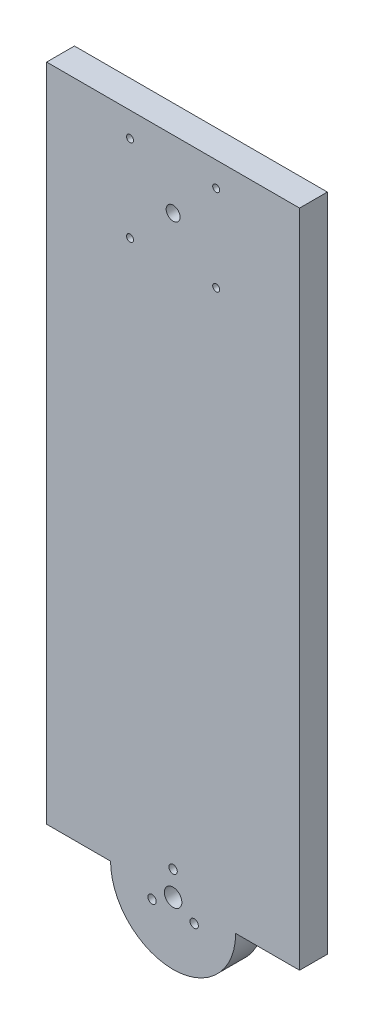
ISO-10303-21;
HEADER;
FILE_DESCRIPTION(('STEP AP214'),'2;1');
FILE_NAME('part.step','',(''),(''),'','','');
FILE_SCHEMA(('AUTOMOTIVE_DESIGN { 1 0 10303 214 1 1 1 1 }'));
ENDSEC;
DATA;
#1=APPLICATION_CONTEXT('core data for automotive mechanical design processes');
#2=APPLICATION_PROTOCOL_DEFINITION('international standard','automotive_design',2000,#1);
#3=PRODUCT_CONTEXT('',#1,'mechanical');
#4=PRODUCT('Part','Part','',(#3));
#5=PRODUCT_RELATED_PRODUCT_CATEGORY('part','',(#4));
#6=PRODUCT_DEFINITION_FORMATION('','',#4);
#7=PRODUCT_DEFINITION_CONTEXT('part definition',#1,'design');
#8=PRODUCT_DEFINITION('design','',#6,#7);
#9=PRODUCT_DEFINITION_SHAPE('','',#8);
#10=(LENGTH_UNIT() NAMED_UNIT(*) SI_UNIT(.MILLI.,.METRE.));
#11=(NAMED_UNIT(*) PLANE_ANGLE_UNIT() SI_UNIT($,.RADIAN.));
#12=(NAMED_UNIT(*) SI_UNIT($,.STERADIAN.) SOLID_ANGLE_UNIT());
#13=UNCERTAINTY_MEASURE_WITH_UNIT(LENGTH_MEASURE(1.E-05),#10,'distance_accuracy_value','');
#14=(GEOMETRIC_REPRESENTATION_CONTEXT(3) GLOBAL_UNCERTAINTY_ASSIGNED_CONTEXT((#13)) GLOBAL_UNIT_ASSIGNED_CONTEXT((#10,
#11,#12)) REPRESENTATION_CONTEXT('',''));
#15=CARTESIAN_POINT('',(0.,0.,0.));
#16=DIRECTION('',(0.,0.,1.));
#17=DIRECTION('',(1.,0.,0.));
#18=AXIS2_PLACEMENT_3D('',#15,#16,#17);
#19=CARTESIAN_POINT('',(5.46437894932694E-12,-107.5,10.));
#20=DIRECTION('',(0.,0.,1.));
#21=DIRECTION('',(1.,0.,0.));
#22=AXIS2_PLACEMENT_3D('',#19,#20,#21);
#23=PLANE('',#22);
#24=CARTESIAN_POINT('',(7.57772228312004,-111.875,10.));
#25=DIRECTION('',(0.,0.,1.));
#26=DIRECTION('',(1.,0.,0.));
#27=AXIS2_PLACEMENT_3D('',#24,#25,#26);
#28=CIRCLE('',#27,1.5);
#29=CARTESIAN_POINT('',(9.07772228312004,-111.875,10.));
#30=VERTEX_POINT('',#29);
#31=EDGE_CURVE('E134',#30,#30,#28,.T.);
#32=ORIENTED_EDGE('',*,*,#31,.F.);
#33=EDGE_LOOP('',(#32));
#34=FACE_BOUND('',#33,.T.);
#35=CARTESIAN_POINT('',(5.46437894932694E-12,-98.75,10.));
#36=DIRECTION('',(0.,0.,1.));
#37=DIRECTION('',(1.,0.,0.));
#38=AXIS2_PLACEMENT_3D('',#35,#36,#37);
#39=CIRCLE('',#38,1.5);
#40=CARTESIAN_POINT('',(1.50000000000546,-98.75,10.));
#41=VERTEX_POINT('',#40);
#42=EDGE_CURVE('E146',#41,#41,#39,.T.);
#43=ORIENTED_EDGE('',*,*,#42,.F.);
#44=EDGE_LOOP('',(#43));
#45=FACE_BOUND('',#44,.T.);
#46=CARTESIAN_POINT('',(-15.4999999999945,90.1639203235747,10.));
#47=DIRECTION('',(0.,0.,1.));
#48=DIRECTION('',(-1.,0.,0.));
#49=AXIS2_PLACEMENT_3D('',#46,#47,#48);
#50=CIRCLE('',#49,1.25);
#51=CARTESIAN_POINT('',(-16.7499999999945,90.1639203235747,10.));
#52=VERTEX_POINT('',#51);
#53=EDGE_CURVE('E158',#52,#52,#50,.T.);
#54=ORIENTED_EDGE('',*,*,#53,.F.);
#55=EDGE_LOOP('',(#54));
#56=FACE_BOUND('',#55,.T.);
#57=CARTESIAN_POINT('',(15.5000000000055,121.163920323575,10.));
#58=DIRECTION('',(0.,0.,1.));
#59=DIRECTION('',(-1.,0.,0.));
#60=AXIS2_PLACEMENT_3D('',#57,#58,#59);
#61=CIRCLE('',#60,1.25);
#62=CARTESIAN_POINT('',(14.2500000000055,121.163920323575,10.));
#63=VERTEX_POINT('',#62);
#64=EDGE_CURVE('E170',#63,#63,#61,.T.);
#65=ORIENTED_EDGE('',*,*,#64,.F.);
#66=EDGE_LOOP('',(#65));
#67=FACE_BOUND('',#66,.T.);
#68=DIRECTION('',(-1.,0.,0.));
#69=VECTOR('',#68,1.);
#70=CARTESIAN_POINT('',(-22.5,130.,10.));
#71=LINE('',#70,#69);
#72=CARTESIAN_POINT('',(45.5,130.,10.));
#73=VERTEX_POINT('',#72);
#74=CARTESIAN_POINT('',(-45.5,130.,10.));
#75=VERTEX_POINT('',#74);
#76=EDGE_CURVE('E182',#73,#75,#71,.T.);
#77=ORIENTED_EDGE('',*,*,#76,.T.);
#78=DIRECTION('',(0.,1.,0.));
#79=VECTOR('',#78,1.);
#80=CARTESIAN_POINT('',(-45.5,130.,10.));
#81=LINE('',#80,#79);
#82=CARTESIAN_POINT('',(-45.5,-107.5,10.));
#83=VERTEX_POINT('',#82);
#84=EDGE_CURVE('E93',#83,#75,#81,.T.);
#85=ORIENTED_EDGE('',*,*,#84,.F.);
#86=DIRECTION('',(1.,0.,0.));
#87=VECTOR('',#86,1.);
#88=CARTESIAN_POINT('',(-45.5,-107.5,10.));
#89=LINE('',#88,#87);
#90=CARTESIAN_POINT('',(-22.4999999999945,-107.5,10.));
#91=VERTEX_POINT('',#90);
#92=EDGE_CURVE('E89',#83,#91,#89,.T.);
#93=ORIENTED_EDGE('',*,*,#92,.T.);
#94=CARTESIAN_POINT('',(5.46437894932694E-12,-107.5,10.));
#95=DIRECTION('',(0.,0.,1.));
#96=DIRECTION('',(1.,0.,0.));
#97=AXIS2_PLACEMENT_3D('',#94,#95,#96);
#98=CIRCLE('',#97,22.5);
#99=CARTESIAN_POINT('',(22.5,-107.5,10.));
#100=VERTEX_POINT('',#99);
#101=EDGE_CURVE('E47',#91,#100,#98,.T.);
#102=ORIENTED_EDGE('',*,*,#101,.T.);
#103=DIRECTION('',(-1.,0.,0.));
#104=VECTOR('',#103,1.);
#105=CARTESIAN_POINT('',(45.5,-107.5,10.));
#106=LINE('',#105,#104);
#107=CARTESIAN_POINT('',(45.5,-107.5,10.));
#108=VERTEX_POINT('',#107);
#109=EDGE_CURVE('E125',#108,#100,#106,.T.);
#110=ORIENTED_EDGE('',*,*,#109,.F.);
#111=DIRECTION('',(0.,-1.,0.));
#112=VECTOR('',#111,1.);
#113=CARTESIAN_POINT('',(45.5,130.,10.));
#114=LINE('',#113,#112);
#115=EDGE_CURVE('E108',#73,#108,#114,.T.);
#116=ORIENTED_EDGE('',*,*,#115,.F.);
#117=EDGE_LOOP('',(#77,#85,#93,#102,#110,#116));
#118=FACE_BOUND('',#117,.T.);
#119=CARTESIAN_POINT('',(-15.4999999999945,121.163920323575,10.));
#120=DIRECTION('',(0.,0.,1.));
#121=DIRECTION('',(1.,0.,0.));
#122=AXIS2_PLACEMENT_3D('',#119,#120,#121);
#123=CIRCLE('',#122,1.25);
#124=CARTESIAN_POINT('',(-14.2499999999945,121.163920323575,10.));
#125=VERTEX_POINT('',#124);
#126=EDGE_CURVE('E176',#125,#125,#123,.T.);
#127=ORIENTED_EDGE('',*,*,#126,.F.);
#128=EDGE_LOOP('',(#127));
#129=FACE_BOUND('',#128,.T.);
#130=CARTESIAN_POINT('',(15.5000000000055,90.1639203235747,10.));
#131=DIRECTION('',(0.,0.,1.));
#132=DIRECTION('',(1.,0.,0.));
#133=AXIS2_PLACEMENT_3D('',#130,#131,#132);
#134=CIRCLE('',#133,1.25);
#135=CARTESIAN_POINT('',(16.7500000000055,90.1639203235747,10.));
#136=VERTEX_POINT('',#135);
#137=EDGE_CURVE('E164',#136,#136,#134,.T.);
#138=ORIENTED_EDGE('',*,*,#137,.F.);
#139=EDGE_LOOP('',(#138));
#140=FACE_BOUND('',#139,.T.);
#141=CARTESIAN_POINT('',(5.4678483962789E-12,105.663920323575,10.));
#142=DIRECTION('',(0.,0.,1.));
#143=DIRECTION('',(1.,0.,0.));
#144=AXIS2_PLACEMENT_3D('',#141,#142,#143);
#145=CIRCLE('',#144,2.5);
#146=CARTESIAN_POINT('',(2.50000000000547,105.663920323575,10.));
#147=VERTEX_POINT('',#146);
#148=EDGE_CURVE('E152',#147,#147,#145,.T.);
#149=ORIENTED_EDGE('',*,*,#148,.F.);
#150=EDGE_LOOP('',(#149));
#151=FACE_BOUND('',#150,.T.);
#152=CARTESIAN_POINT('',(5.46437894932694E-12,-107.5,10.));
#153=DIRECTION('',(0.,0.,1.));
#154=DIRECTION('',(1.,0.,0.));
#155=AXIS2_PLACEMENT_3D('',#152,#153,#154);
#156=CIRCLE('',#155,3.15);
#157=CARTESIAN_POINT('',(3.15000000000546,-107.5,10.));
#158=VERTEX_POINT('',#157);
#159=EDGE_CURVE('E140',#158,#158,#156,.T.);
#160=ORIENTED_EDGE('',*,*,#159,.F.);
#161=EDGE_LOOP('',(#160));
#162=FACE_BOUND('',#161,.T.);
#163=CARTESIAN_POINT('',(-7.5777222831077,-111.875,10.));
#164=DIRECTION('',(0.,0.,1.));
#165=DIRECTION('',(1.,0.,0.));
#166=AXIS2_PLACEMENT_3D('',#163,#164,#165);
#167=CIRCLE('',#166,1.49999999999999);
#168=CARTESIAN_POINT('',(-6.07772228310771,-111.875,10.));
#169=VERTEX_POINT('',#168);
#170=EDGE_CURVE('E128',#169,#169,#167,.T.);
#171=ORIENTED_EDGE('',*,*,#170,.F.);
#172=EDGE_LOOP('',(#171));
#173=FACE_BOUND('',#172,.T.);
#174=ADVANCED_FACE('F33',(#34,#45,#56,#67,#118,#129,#140,#151,#162,#173),#23,.T.);
#175=CARTESIAN_POINT('',(5.46437894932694E-12,-107.5,0.));
#176=DIRECTION('',(0.,0.,1.));
#177=DIRECTION('',(1.,0.,0.));
#178=AXIS2_PLACEMENT_3D('',#175,#176,#177);
#179=PLANE('',#178);
#180=CARTESIAN_POINT('',(5.46437894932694E-12,-107.5,0.));
#181=DIRECTION('',(0.,0.,1.));
#182=DIRECTION('',(1.,0.,0.));
#183=AXIS2_PLACEMENT_3D('',#180,#181,#182);
#184=CIRCLE('',#183,22.5);
#185=CARTESIAN_POINT('',(-22.4999999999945,-107.5,0.));
#186=VERTEX_POINT('',#185);
#187=CARTESIAN_POINT('',(22.5,-107.5,0.));
#188=VERTEX_POINT('',#187);
#189=EDGE_CURVE('E107',#186,#188,#184,.T.);
#190=ORIENTED_EDGE('',*,*,#189,.F.);
#191=DIRECTION('',(1.,0.,0.));
#192=VECTOR('',#191,1.);
#193=CARTESIAN_POINT('',(-45.5,-107.5,0.));
#194=LINE('',#193,#192);
#195=CARTESIAN_POINT('',(-45.5,-107.5,0.));
#196=VERTEX_POINT('',#195);
#197=EDGE_CURVE('E87',#196,#186,#194,.T.);
#198=ORIENTED_EDGE('',*,*,#197,.F.);
#199=DIRECTION('',(0.,-1.,0.));
#200=VECTOR('',#199,1.);
#201=CARTESIAN_POINT('',(-45.5,130.,0.));
#202=LINE('',#201,#200);
#203=CARTESIAN_POINT('',(-45.5,130.,0.));
#204=VERTEX_POINT('',#203);
#205=EDGE_CURVE('E94',#204,#196,#202,.T.);
#206=ORIENTED_EDGE('',*,*,#205,.F.);
#207=DIRECTION('',(-1.,0.,0.));
#208=VECTOR('',#207,1.);
#209=CARTESIAN_POINT('',(-22.5,130.,0.));
#210=LINE('',#209,#208);
#211=CARTESIAN_POINT('',(45.5,130.,0.));
#212=VERTEX_POINT('',#211);
#213=EDGE_CURVE('E183',#212,#204,#210,.T.);
#214=ORIENTED_EDGE('',*,*,#213,.F.);
#215=DIRECTION('',(0.,1.,0.));
#216=VECTOR('',#215,1.);
#217=CARTESIAN_POINT('',(45.5,130.,0.));
#218=LINE('',#217,#216);
#219=CARTESIAN_POINT('',(45.5,-107.5,0.));
#220=VERTEX_POINT('',#219);
#221=EDGE_CURVE('E117',#220,#212,#218,.T.);
#222=ORIENTED_EDGE('',*,*,#221,.F.);
#223=DIRECTION('',(-1.,0.,0.));
#224=VECTOR('',#223,1.);
#225=CARTESIAN_POINT('',(45.5,-107.5,0.));
#226=LINE('',#225,#224);
#227=EDGE_CURVE('E123',#220,#188,#226,.T.);
#228=ORIENTED_EDGE('',*,*,#227,.T.);
#229=EDGE_LOOP('',(#190,#198,#206,#214,#222,#228));
#230=FACE_BOUND('',#229,.T.);
#231=CARTESIAN_POINT('',(-15.4999999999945,121.163920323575,0.));
#232=DIRECTION('',(0.,0.,1.));
#233=DIRECTION('',(1.,0.,0.));
#234=AXIS2_PLACEMENT_3D('',#231,#232,#233);
#235=CIRCLE('',#234,1.25);
#236=CARTESIAN_POINT('',(-14.2499999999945,121.163920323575,0.));
#237=VERTEX_POINT('',#236);
#238=EDGE_CURVE('E173',#237,#237,#235,.T.);
#239=ORIENTED_EDGE('',*,*,#238,.T.);
#240=EDGE_LOOP('',(#239));
#241=FACE_BOUND('',#240,.T.);
#242=CARTESIAN_POINT('',(15.5000000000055,121.163920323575,0.));
#243=DIRECTION('',(0.,0.,1.));
#244=DIRECTION('',(-1.,0.,0.));
#245=AXIS2_PLACEMENT_3D('',#242,#243,#244);
#246=CIRCLE('',#245,1.25);
#247=CARTESIAN_POINT('',(14.2500000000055,121.163920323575,0.));
#248=VERTEX_POINT('',#247);
#249=EDGE_CURVE('E167',#248,#248,#246,.T.);
#250=ORIENTED_EDGE('',*,*,#249,.T.);
#251=EDGE_LOOP('',(#250));
#252=FACE_BOUND('',#251,.T.);
#253=CARTESIAN_POINT('',(15.5000000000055,90.1639203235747,0.));
#254=DIRECTION('',(0.,0.,1.));
#255=DIRECTION('',(1.,0.,0.));
#256=AXIS2_PLACEMENT_3D('',#253,#254,#255);
#257=CIRCLE('',#256,1.25);
#258=CARTESIAN_POINT('',(16.7500000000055,90.1639203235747,0.));
#259=VERTEX_POINT('',#258);
#260=EDGE_CURVE('E161',#259,#259,#257,.T.);
#261=ORIENTED_EDGE('',*,*,#260,.T.);
#262=EDGE_LOOP('',(#261));
#263=FACE_BOUND('',#262,.T.);
#264=CARTESIAN_POINT('',(-15.4999999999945,90.1639203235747,0.));
#265=DIRECTION('',(0.,0.,1.));
#266=DIRECTION('',(-1.,0.,0.));
#267=AXIS2_PLACEMENT_3D('',#264,#265,#266);
#268=CIRCLE('',#267,1.25);
#269=CARTESIAN_POINT('',(-16.7499999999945,90.1639203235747,0.));
#270=VERTEX_POINT('',#269);
#271=EDGE_CURVE('E155',#270,#270,#268,.T.);
#272=ORIENTED_EDGE('',*,*,#271,.T.);
#273=EDGE_LOOP('',(#272));
#274=FACE_BOUND('',#273,.T.);
#275=CARTESIAN_POINT('',(5.4678483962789E-12,105.663920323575,0.));
#276=DIRECTION('',(0.,0.,1.));
#277=DIRECTION('',(1.,0.,0.));
#278=AXIS2_PLACEMENT_3D('',#275,#276,#277);
#279=CIRCLE('',#278,2.5);
#280=CARTESIAN_POINT('',(2.50000000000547,105.663920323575,0.));
#281=VERTEX_POINT('',#280);
#282=EDGE_CURVE('E149',#281,#281,#279,.T.);
#283=ORIENTED_EDGE('',*,*,#282,.T.);
#284=EDGE_LOOP('',(#283));
#285=FACE_BOUND('',#284,.T.);
#286=CARTESIAN_POINT('',(5.46437894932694E-12,-98.75,0.));
#287=DIRECTION('',(0.,0.,1.));
#288=DIRECTION('',(1.,0.,0.));
#289=AXIS2_PLACEMENT_3D('',#286,#287,#288);
#290=CIRCLE('',#289,1.5);
#291=CARTESIAN_POINT('',(1.50000000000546,-98.75,0.));
#292=VERTEX_POINT('',#291);
#293=EDGE_CURVE('E143',#292,#292,#290,.T.);
#294=ORIENTED_EDGE('',*,*,#293,.T.);
#295=EDGE_LOOP('',(#294));
#296=FACE_BOUND('',#295,.T.);
#297=CARTESIAN_POINT('',(5.46437894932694E-12,-107.5,0.));
#298=DIRECTION('',(0.,0.,1.));
#299=DIRECTION('',(1.,0.,0.));
#300=AXIS2_PLACEMENT_3D('',#297,#298,#299);
#301=CIRCLE('',#300,3.15);
#302=CARTESIAN_POINT('',(3.15000000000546,-107.5,0.));
#303=VERTEX_POINT('',#302);
#304=EDGE_CURVE('E137',#303,#303,#301,.T.);
#305=ORIENTED_EDGE('',*,*,#304,.T.);
#306=EDGE_LOOP('',(#305));
#307=FACE_BOUND('',#306,.T.);
#308=CARTESIAN_POINT('',(7.57772228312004,-111.875,0.));
#309=DIRECTION('',(0.,0.,1.));
#310=DIRECTION('',(1.,0.,0.));
#311=AXIS2_PLACEMENT_3D('',#308,#309,#310);
#312=CIRCLE('',#311,1.5);
#313=CARTESIAN_POINT('',(9.07772228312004,-111.875,0.));
#314=VERTEX_POINT('',#313);
#315=EDGE_CURVE('E131',#314,#314,#312,.T.);
#316=ORIENTED_EDGE('',*,*,#315,.T.);
#317=EDGE_LOOP('',(#316));
#318=FACE_BOUND('',#317,.T.);
#319=CARTESIAN_POINT('',(-7.5777222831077,-111.875,0.));
#320=DIRECTION('',(0.,0.,1.));
#321=DIRECTION('',(1.,0.,0.));
#322=AXIS2_PLACEMENT_3D('',#319,#320,#321);
#323=CIRCLE('',#322,1.49999999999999);
#324=CARTESIAN_POINT('',(-6.07772228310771,-111.875,0.));
#325=VERTEX_POINT('',#324);
#326=EDGE_CURVE('E127',#325,#325,#323,.T.);
#327=ORIENTED_EDGE('',*,*,#326,.T.);
#328=EDGE_LOOP('',(#327));
#329=FACE_BOUND('',#328,.T.);
#330=ADVANCED_FACE('F103',(#230,#241,#252,#263,#274,#285,#296,#307,#318,#329),#179,.F.);
#331=CARTESIAN_POINT('',(5.46437894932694E-12,-107.5,10.));
#332=DIRECTION('',(0.,0.,-1.));
#333=DIRECTION('',(-1.,0.,0.));
#334=AXIS2_PLACEMENT_3D('',#331,#332,#333);
#335=CYLINDRICAL_SURFACE('',#334,22.5);
#336=ORIENTED_EDGE('',*,*,#189,.T.);
#337=DIRECTION('',(0.,0.,-1.));
#338=VECTOR('',#337,1.);
#339=CARTESIAN_POINT('',(22.5,-107.5,10.));
#340=LINE('',#339,#338);
#341=EDGE_CURVE('E42',#100,#188,#340,.T.);
#342=ORIENTED_EDGE('',*,*,#341,.F.);
#343=ORIENTED_EDGE('',*,*,#101,.F.);
#344=DIRECTION('',(0.,0.,-1.));
#345=VECTOR('',#344,1.);
#346=CARTESIAN_POINT('',(-22.4999999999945,-107.5,10.));
#347=LINE('',#346,#345);
#348=EDGE_CURVE('E11',#91,#186,#347,.T.);
#349=ORIENTED_EDGE('',*,*,#348,.T.);
#350=EDGE_LOOP('',(#336,#342,#343,#349));
#351=FACE_BOUND('',#350,.T.);
#352=ADVANCED_FACE('F35',(#351),#335,.T.);
#353=CARTESIAN_POINT('',(-22.5,130.,10.));
#354=DIRECTION('',(0.,-1.,0.));
#355=DIRECTION('',(0.,0.,-1.));
#356=AXIS2_PLACEMENT_3D('',#353,#354,#355);
#357=PLANE('',#356);
#358=ORIENTED_EDGE('',*,*,#213,.T.);
#359=DIRECTION('',(0.,0.,-1.));
#360=VECTOR('',#359,1.);
#361=CARTESIAN_POINT('',(-45.5,130.,0.));
#362=LINE('',#361,#360);
#363=EDGE_CURVE('E100',#75,#204,#362,.T.);
#364=ORIENTED_EDGE('',*,*,#363,.F.);
#365=ORIENTED_EDGE('',*,*,#76,.F.);
#366=DIRECTION('',(0.,0.,1.));
#367=VECTOR('',#366,1.);
#368=CARTESIAN_POINT('',(45.5,130.,10.));
#369=LINE('',#368,#367);
#370=EDGE_CURVE('E120',#212,#73,#369,.T.);
#371=ORIENTED_EDGE('',*,*,#370,.F.);
#372=EDGE_LOOP('',(#358,#364,#365,#371));
#373=FACE_BOUND('',#372,.T.);
#374=ADVANCED_FACE('F196',(#373),#357,.F.);
#375=CARTESIAN_POINT('',(-15.4999999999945,121.163920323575,10.));
#376=DIRECTION('',(0.,0.,-1.));
#377=DIRECTION('',(-1.,0.,0.));
#378=AXIS2_PLACEMENT_3D('',#375,#376,#377);
#379=CYLINDRICAL_SURFACE('',#378,1.25);
#380=ORIENTED_EDGE('',*,*,#126,.T.);
#381=EDGE_LOOP('',(#380));
#382=FACE_BOUND('',#381,.T.);
#383=ORIENTED_EDGE('',*,*,#238,.F.);
#384=EDGE_LOOP('',(#383));
#385=FACE_BOUND('',#384,.T.);
#386=ADVANCED_FACE('F220',(#382,#385),#379,.F.);
#387=CARTESIAN_POINT('',(15.5000000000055,121.163920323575,10.));
#388=DIRECTION('',(0.,0.,-1.));
#389=DIRECTION('',(-1.,0.,0.));
#390=AXIS2_PLACEMENT_3D('',#387,#388,#389);
#391=CYLINDRICAL_SURFACE('',#390,1.25);
#392=ORIENTED_EDGE('',*,*,#64,.T.);
#393=EDGE_LOOP('',(#392));
#394=FACE_BOUND('',#393,.T.);
#395=ORIENTED_EDGE('',*,*,#249,.F.);
#396=EDGE_LOOP('',(#395));
#397=FACE_BOUND('',#396,.T.);
#398=ADVANCED_FACE('F226',(#394,#397),#391,.F.);
#399=CARTESIAN_POINT('',(15.5000000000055,90.1639203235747,10.));
#400=DIRECTION('',(0.,0.,-1.));
#401=DIRECTION('',(-1.,0.,0.));
#402=AXIS2_PLACEMENT_3D('',#399,#400,#401);
#403=CYLINDRICAL_SURFACE('',#402,1.25);
#404=ORIENTED_EDGE('',*,*,#137,.T.);
#405=EDGE_LOOP('',(#404));
#406=FACE_BOUND('',#405,.T.);
#407=ORIENTED_EDGE('',*,*,#260,.F.);
#408=EDGE_LOOP('',(#407));
#409=FACE_BOUND('',#408,.T.);
#410=ADVANCED_FACE('F336',(#406,#409),#403,.F.);
#411=CARTESIAN_POINT('',(-15.4999999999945,90.1639203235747,10.));
#412=DIRECTION('',(0.,0.,-1.));
#413=DIRECTION('',(-1.,0.,0.));
#414=AXIS2_PLACEMENT_3D('',#411,#412,#413);
#415=CYLINDRICAL_SURFACE('',#414,1.25);
#416=ORIENTED_EDGE('',*,*,#53,.T.);
#417=EDGE_LOOP('',(#416));
#418=FACE_BOUND('',#417,.T.);
#419=ORIENTED_EDGE('',*,*,#271,.F.);
#420=EDGE_LOOP('',(#419));
#421=FACE_BOUND('',#420,.T.);
#422=ADVANCED_FACE('F326',(#418,#421),#415,.F.);
#423=CARTESIAN_POINT('',(5.4678483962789E-12,105.663920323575,10.));
#424=DIRECTION('',(0.,0.,-1.));
#425=DIRECTION('',(-1.,0.,0.));
#426=AXIS2_PLACEMENT_3D('',#423,#424,#425);
#427=CYLINDRICAL_SURFACE('',#426,2.5);
#428=ORIENTED_EDGE('',*,*,#148,.T.);
#429=EDGE_LOOP('',(#428));
#430=FACE_BOUND('',#429,.T.);
#431=ORIENTED_EDGE('',*,*,#282,.F.);
#432=EDGE_LOOP('',(#431));
#433=FACE_BOUND('',#432,.T.);
#434=ADVANCED_FACE('F316',(#430,#433),#427,.F.);
#435=CARTESIAN_POINT('',(5.46437894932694E-12,-98.75,10.));
#436=DIRECTION('',(0.,0.,-1.));
#437=DIRECTION('',(-1.,0.,0.));
#438=AXIS2_PLACEMENT_3D('',#435,#436,#437);
#439=CYLINDRICAL_SURFACE('',#438,1.5);
#440=ORIENTED_EDGE('',*,*,#42,.T.);
#441=EDGE_LOOP('',(#440));
#442=FACE_BOUND('',#441,.T.);
#443=ORIENTED_EDGE('',*,*,#293,.F.);
#444=EDGE_LOOP('',(#443));
#445=FACE_BOUND('',#444,.T.);
#446=ADVANCED_FACE('F306',(#442,#445),#439,.F.);
#447=CARTESIAN_POINT('',(5.46437894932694E-12,-107.5,10.));
#448=DIRECTION('',(0.,0.,-1.));
#449=DIRECTION('',(-1.,0.,0.));
#450=AXIS2_PLACEMENT_3D('',#447,#448,#449);
#451=CYLINDRICAL_SURFACE('',#450,3.15);
#452=ORIENTED_EDGE('',*,*,#159,.T.);
#453=EDGE_LOOP('',(#452));
#454=FACE_BOUND('',#453,.T.);
#455=ORIENTED_EDGE('',*,*,#304,.F.);
#456=EDGE_LOOP('',(#455));
#457=FACE_BOUND('',#456,.T.);
#458=ADVANCED_FACE('F296',(#454,#457),#451,.F.);
#459=CARTESIAN_POINT('',(7.57772228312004,-111.875,10.));
#460=DIRECTION('',(0.,0.,-1.));
#461=DIRECTION('',(-1.,0.,0.));
#462=AXIS2_PLACEMENT_3D('',#459,#460,#461);
#463=CYLINDRICAL_SURFACE('',#462,1.5);
#464=ORIENTED_EDGE('',*,*,#31,.T.);
#465=EDGE_LOOP('',(#464));
#466=FACE_BOUND('',#465,.T.);
#467=ORIENTED_EDGE('',*,*,#315,.F.);
#468=EDGE_LOOP('',(#467));
#469=FACE_BOUND('',#468,.T.);
#470=ADVANCED_FACE('F286',(#466,#469),#463,.F.);
#471=CARTESIAN_POINT('',(-7.5777222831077,-111.875,10.));
#472=DIRECTION('',(0.,0.,-1.));
#473=DIRECTION('',(-1.,0.,0.));
#474=AXIS2_PLACEMENT_3D('',#471,#472,#473);
#475=CYLINDRICAL_SURFACE('',#474,1.49999999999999);
#476=ORIENTED_EDGE('',*,*,#170,.T.);
#477=EDGE_LOOP('',(#476));
#478=FACE_BOUND('',#477,.T.);
#479=ORIENTED_EDGE('',*,*,#326,.F.);
#480=EDGE_LOOP('',(#479));
#481=FACE_BOUND('',#480,.T.);
#482=ADVANCED_FACE('F207',(#478,#481),#475,.F.);
#483=CARTESIAN_POINT('',(45.5,-107.5,10.));
#484=DIRECTION('',(0.,1.,0.));
#485=DIRECTION('',(-1.,0.,0.));
#486=AXIS2_PLACEMENT_3D('',#483,#484,#485);
#487=PLANE('',#486);
#488=ORIENTED_EDGE('',*,*,#341,.T.);
#489=ORIENTED_EDGE('',*,*,#227,.F.);
#490=DIRECTION('',(0.,0.,-1.));
#491=VECTOR('',#490,1.);
#492=CARTESIAN_POINT('',(45.5,-107.5,10.));
#493=LINE('',#492,#491);
#494=EDGE_CURVE('E111',#108,#220,#493,.T.);
#495=ORIENTED_EDGE('',*,*,#494,.F.);
#496=ORIENTED_EDGE('',*,*,#109,.T.);
#497=EDGE_LOOP('',(#488,#489,#495,#496));
#498=FACE_BOUND('',#497,.T.);
#499=ADVANCED_FACE('F188',(#498),#487,.F.);
#500=CARTESIAN_POINT('',(45.5,0.,0.));
#501=DIRECTION('',(1.,0.,0.));
#502=DIRECTION('',(0.,1.,0.));
#503=AXIS2_PLACEMENT_3D('',#500,#501,#502);
#504=PLANE('',#503);
#505=ORIENTED_EDGE('',*,*,#115,.T.);
#506=ORIENTED_EDGE('',*,*,#494,.T.);
#507=ORIENTED_EDGE('',*,*,#221,.T.);
#508=ORIENTED_EDGE('',*,*,#370,.T.);
#509=EDGE_LOOP('',(#505,#506,#507,#508));
#510=FACE_BOUND('',#509,.T.);
#511=ADVANCED_FACE('F199',(#510),#504,.T.);
#512=CARTESIAN_POINT('',(-45.5,-107.5,0.));
#513=DIRECTION('',(0.,1.,0.));
#514=DIRECTION('',(-1.,0.,0.));
#515=AXIS2_PLACEMENT_3D('',#512,#513,#514);
#516=PLANE('',#515);
#517=ORIENTED_EDGE('',*,*,#348,.F.);
#518=ORIENTED_EDGE('',*,*,#92,.F.);
#519=DIRECTION('',(0.,0.,1.));
#520=VECTOR('',#519,1.);
#521=CARTESIAN_POINT('',(-45.5,-107.5,0.));
#522=LINE('',#521,#520);
#523=EDGE_CURVE('E83',#196,#83,#522,.T.);
#524=ORIENTED_EDGE('',*,*,#523,.F.);
#525=ORIENTED_EDGE('',*,*,#197,.T.);
#526=EDGE_LOOP('',(#517,#518,#524,#525));
#527=FACE_BOUND('',#526,.T.);
#528=ADVANCED_FACE('F85',(#527),#516,.F.);
#529=CARTESIAN_POINT('',(-45.5,0.,0.));
#530=DIRECTION('',(-1.,0.,0.));
#531=DIRECTION('',(0.,-1.,0.));
#532=AXIS2_PLACEMENT_3D('',#529,#530,#531);
#533=PLANE('',#532);
#534=ORIENTED_EDGE('',*,*,#205,.T.);
#535=ORIENTED_EDGE('',*,*,#523,.T.);
#536=ORIENTED_EDGE('',*,*,#84,.T.);
#537=ORIENTED_EDGE('',*,*,#363,.T.);
#538=EDGE_LOOP('',(#534,#535,#536,#537));
#539=FACE_BOUND('',#538,.T.);
#540=ADVANCED_FACE('F98',(#539),#533,.T.);
#541=CLOSED_SHELL('',(#174,#330,#352,#374,#386,#398,#410,#422,#434,#446,#458,#470,#482,#499,
#511,#528,#540));
#542=MANIFOLD_SOLID_BREP('B2',#541);
#543=ADVANCED_BREP_SHAPE_REPRESENTATION('',(#18,#542),#14);
#544=SHAPE_DEFINITION_REPRESENTATION(#9,#543);
ENDSEC;
END-ISO-10303-21;
